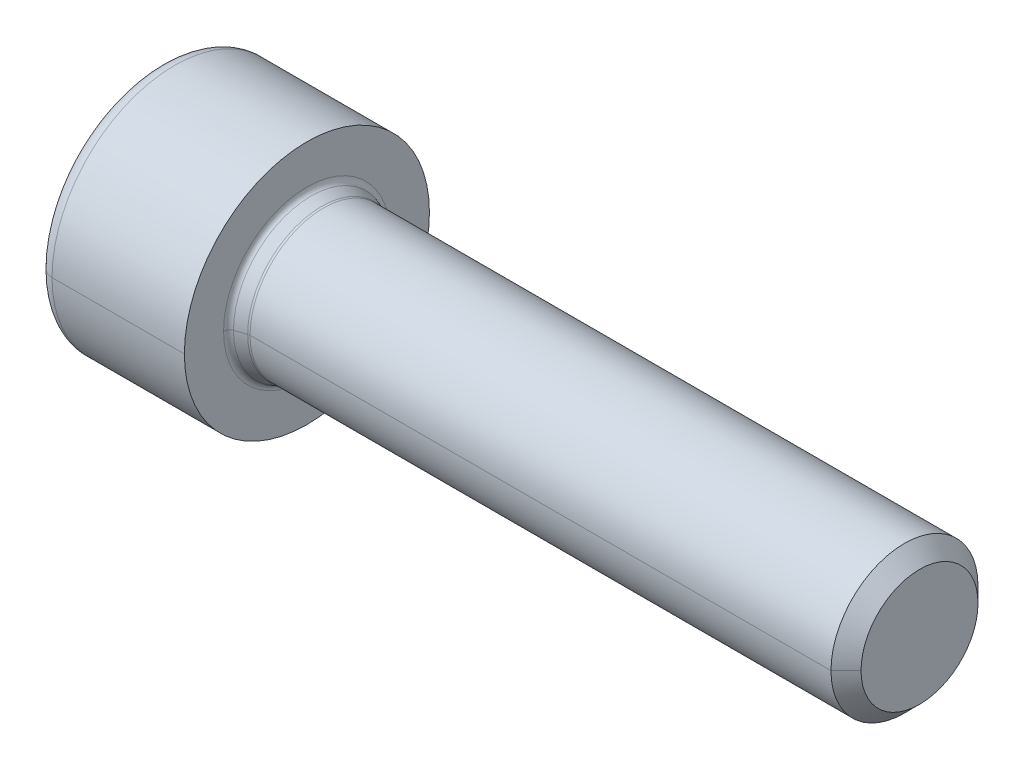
ISO-10303-21;
HEADER;
FILE_DESCRIPTION(('STEP AP214'),'2;1');
FILE_NAME('part.step','',(''),(''),'','','');
FILE_SCHEMA(('AUTOMOTIVE_DESIGN { 1 0 10303 214 1 1 1 1 }'));
ENDSEC;
DATA;
#1=APPLICATION_CONTEXT('core data for automotive mechanical design processes');
#2=APPLICATION_PROTOCOL_DEFINITION('international standard','automotive_design',2000,#1);
#3=PRODUCT_CONTEXT('',#1,'mechanical');
#4=PRODUCT('Part','Part','',(#3));
#5=PRODUCT_RELATED_PRODUCT_CATEGORY('part','',(#4));
#6=PRODUCT_DEFINITION_FORMATION('','',#4);
#7=PRODUCT_DEFINITION_CONTEXT('part definition',#1,'design');
#8=PRODUCT_DEFINITION('design','',#6,#7);
#9=PRODUCT_DEFINITION_SHAPE('','',#8);
#10=(LENGTH_UNIT() NAMED_UNIT(*) SI_UNIT(.MILLI.,.METRE.));
#11=(NAMED_UNIT(*) PLANE_ANGLE_UNIT() SI_UNIT($,.RADIAN.));
#12=(NAMED_UNIT(*) SI_UNIT($,.STERADIAN.) SOLID_ANGLE_UNIT());
#13=UNCERTAINTY_MEASURE_WITH_UNIT(LENGTH_MEASURE(1.E-05),#10,'distance_accuracy_value','');
#14=(GEOMETRIC_REPRESENTATION_CONTEXT(3) GLOBAL_UNCERTAINTY_ASSIGNED_CONTEXT((#13)) GLOBAL_UNIT_ASSIGNED_CONTEXT((#10,
#11,#12)) REPRESENTATION_CONTEXT('',''));
#15=CARTESIAN_POINT('',(0.,0.,0.));
#16=DIRECTION('',(0.,0.,1.));
#17=DIRECTION('',(1.,0.,0.));
#18=AXIS2_PLACEMENT_3D('',#15,#16,#17);
#19=CARTESIAN_POINT('',(-5.819999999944,0.,0.));
#20=DIRECTION('',(-1.,0.,0.));
#21=DIRECTION('',(0.,0.,1.));
#22=AXIS2_PLACEMENT_3D('',#19,#20,#21);
#23=CONICAL_SURFACE('',#22,2.680000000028,0.785398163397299);
#24=CARTESIAN_POINT('',(-5.63999999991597,0.,2.50000000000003));
#25=CARTESIAN_POINT('',(-5.63999755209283,-0.0278620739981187,2.49999893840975));
#26=CARTESIAN_POINT('',(-5.64048147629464,-0.0557238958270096,2.50001574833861));
#27=CARTESIAN_POINT('',(-5.64241318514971,-0.111436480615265,2.50008549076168));
#28=CARTESIAN_POINT('',(-5.64386174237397,-0.139287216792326,2.50013845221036));
#29=CARTESIAN_POINT('',(-5.6477221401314,-0.195042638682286,2.50028118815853));
#30=CARTESIAN_POINT('',(-5.65013812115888,-0.222947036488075,2.50037112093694));
#31=CARTESIAN_POINT('',(-5.65592925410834,-0.278874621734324,2.50058162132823));
#32=CARTESIAN_POINT('',(-5.65931170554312,-0.306897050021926,2.50070242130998));
#33=CARTESIAN_POINT('',(-5.66703289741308,-0.363124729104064,2.50096377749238));
#34=CARTESIAN_POINT('',(-5.67138178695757,-0.391328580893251,2.50110453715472));
#35=CARTESIAN_POINT('',(-5.68103305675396,-0.447982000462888,2.50138986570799));
#36=CARTESIAN_POINT('',(-5.68634803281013,-0.476429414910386,2.50153446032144));
#37=CARTESIAN_POINT('',(-5.69792921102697,-0.533631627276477,2.50180673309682));
#38=CARTESIAN_POINT('',(-5.70421000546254,-0.562383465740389,2.50193408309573));
#39=CARTESIAN_POINT('',(-5.71772088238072,-0.620253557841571,2.50214657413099));
#40=CARTESIAN_POINT('',(-5.72496708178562,-0.649368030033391,2.50223084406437));
#41=CARTESIAN_POINT('',(-5.74839478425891,-0.738364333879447,2.50237698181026));
#42=CARTESIAN_POINT('',(-5.76585707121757,-0.797911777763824,2.50231889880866));
#43=CARTESIAN_POINT('',(-5.80449733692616,-0.919145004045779,2.50163694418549));
#44=CARTESIAN_POINT('',(-5.82581990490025,-0.980783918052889,2.50098422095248));
#45=CARTESIAN_POINT('',(-5.87217205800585,-1.10659561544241,2.49876522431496));
#46=CARTESIAN_POINT('',(-5.89734294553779,-1.17071505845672,2.49714946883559));
#47=CARTESIAN_POINT('',(-5.95142674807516,-1.30182065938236,2.49261729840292));
#48=CARTESIAN_POINT('',(-5.98047335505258,-1.36874940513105,2.48962898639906));
#49=CARTESIAN_POINT('',(-6.01041759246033,-1.43520868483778,2.48585461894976));
#50=B_SPLINE_CURVE_WITH_KNOTS('',3,(#24,#25,#26,#27,#28,#29,#30,#31,#32,#33,#34,#35,#36,#37,#38,
#39,#40,#41,#42,#43,#44,#45,#46,#47,#48,#49),.UNSPECIFIED.,.F.,.F.,(4,2,2,2,2,2,2,2,2,2,2,2,4),
(0.,0.0835815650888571,0.167230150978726,0.251240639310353,0.335903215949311,0.421500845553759,
0.508307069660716,0.596584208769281,0.686582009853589,0.872655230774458,1.06826719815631,
1.27491962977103,1.49391040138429),.UNSPECIFIED.);
#51=CARTESIAN_POINT('',(-5.639999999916,0.,2.5));
#52=VERTEX_POINT('',#51);
#53=CARTESIAN_POINT('',(-6.00966493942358,-1.43845944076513,2.49148506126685));
#54=VERTEX_POINT('',#53);
#55=EDGE_CURVE('E665',#52,#54,#50,.T.);
#56=ORIENTED_EDGE('',*,*,#55,.T.);
#57=CARTESIAN_POINT('',(-6.,0.,2.860000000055));
#58=CARTESIAN_POINT('',(-6.,-0.763915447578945,2.860000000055));
#59=CARTESIAN_POINT('',(-6.,-1.43571045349,2.486723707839));
#60=B_SPLINE_CURVE_WITH_KNOTS('',2,(#57,#58,#59),.UNSPECIFIED.,.F.,.F.,(3,3),(0.,1.),.UNSPECIFIED.);
#61=CARTESIAN_POINT('',(-5.999999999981,0.,2.860000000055));
#62=VERTEX_POINT('',#61);
#63=EDGE_CURVE('E426',#62,#54,#60,.T.);
#64=ORIENTED_EDGE('',*,*,#63,.F.);
#65=DIRECTION('',(0.707106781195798,0.,-0.707106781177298));
#66=VECTOR('',#65,1.);
#67=CARTESIAN_POINT('',(-5.999999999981,0.,2.860000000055));
#68=LINE('',#67,#66);
#69=EDGE_CURVE('E11',#62,#52,#68,.T.);
#70=ORIENTED_EDGE('',*,*,#69,.T.);
#71=EDGE_LOOP('',(#56,#64,#70));
#72=FACE_BOUND('',#71,.T.);
#73=ADVANCED_FACE('F16',(#72),#23,.F.);
#74=CARTESIAN_POINT('',(-5.819999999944,0.,0.));
#75=DIRECTION('',(-1.,0.,0.));
#76=DIRECTION('',(0.,0.,1.));
#77=AXIS2_PLACEMENT_3D('',#74,#75,#76);
#78=CONICAL_SURFACE('',#77,2.680000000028,0.785398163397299);
#79=ORIENTED_EDGE('',*,*,#69,.F.);
#80=CARTESIAN_POINT('',(-6.,1.43755373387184,2.48991654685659));
#81=CARTESIAN_POINT('',(-6.,0.760071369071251,2.860000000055));
#82=CARTESIAN_POINT('',(-6.,0.,2.860000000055));
#83=B_SPLINE_CURVE_WITH_KNOTS('',2,(#80,#81,#82),.UNSPECIFIED.,.F.,.F.,(3,3),(0.,1.),.UNSPECIFIED.);
#84=CARTESIAN_POINT('',(-6.01203462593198,1.43929166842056,2.49292669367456));
#85=VERTEX_POINT('',#84);
#86=EDGE_CURVE('E542',#85,#62,#83,.T.);
#87=ORIENTED_EDGE('',*,*,#86,.F.);
#88=CARTESIAN_POINT('',(-6.01506480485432,1.43753221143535,2.48987926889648));
#89=CARTESIAN_POINT('',(-5.98470006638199,1.37213189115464,2.49255725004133));
#90=CARTESIAN_POINT('',(-5.95529097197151,1.30623933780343,2.49463522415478));
#91=CARTESIAN_POINT('',(-5.90052867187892,1.17690079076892,2.49773772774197));
#92=CARTESIAN_POINT('',(-5.8750427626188,1.11351195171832,2.49881256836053));
#93=CARTESIAN_POINT('',(-5.82810733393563,0.988843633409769,2.50025407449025));
#94=CARTESIAN_POINT('',(-5.80651978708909,0.927616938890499,2.50065343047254));
#95=CARTESIAN_POINT('',(-5.7673932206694,0.806883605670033,2.5010492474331));
#96=CARTESIAN_POINT('',(-5.74971645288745,0.747422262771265,2.50106290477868));
#97=CARTESIAN_POINT('',(-5.72602309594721,0.658418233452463,2.50095720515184));
#98=CARTESIAN_POINT('',(-5.71868687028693,0.62922387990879,2.50090267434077));
#99=CARTESIAN_POINT('',(-5.70500637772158,0.571110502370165,2.50077482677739));
#100=CARTESIAN_POINT('',(-5.69864774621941,0.542194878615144,2.50070183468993));
#101=CARTESIAN_POINT('',(-5.68692113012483,0.484580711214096,2.50055456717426));
#102=CARTESIAN_POINT('',(-5.68154062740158,0.455884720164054,2.50048032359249));
#103=CARTESIAN_POINT('',(-5.67176818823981,0.398648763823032,2.50034310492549));
#104=CARTESIAN_POINT('',(-5.6673660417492,0.370110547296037,2.50028001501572));
#105=CARTESIAN_POINT('',(-5.65954792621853,0.313127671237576,2.50017258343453));
#106=CARTESIAN_POINT('',(-5.6561244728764,0.284684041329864,2.50012809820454));
#107=CARTESIAN_POINT('',(-5.65026066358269,0.227826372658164,2.50005996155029));
#108=CARTESIAN_POINT('',(-5.6478158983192,0.19941278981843,2.50003621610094));
#109=CARTESIAN_POINT('',(-5.64390706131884,0.142550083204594,2.50000662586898));
#110=CARTESIAN_POINT('',(-5.64244189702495,0.114101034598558,2.50000076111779));
#111=CARTESIAN_POINT('',(-5.64048596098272,0.0571013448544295,2.49999693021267));
#112=CARTESIAN_POINT('',(-5.63999752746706,0.0285506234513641,2.4999989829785));
#113=CARTESIAN_POINT('',(-5.63999999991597,0.,2.50000000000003));
#114=B_SPLINE_CURVE_WITH_KNOTS('',3,(#88,#89,#90,#91,#92,#93,#94,#95,#96,#97,#98,#99,#100,#101,
#102,#103,#104,#105,#106,#107,#108,#109,#110,#111,#112,#113),.UNSPECIFIED.,.F.,.F.,(4,2,2,2,2,2,
2,2,2,2,2,2,4),(0.,0.216488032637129,0.421420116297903,0.616116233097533,0.802117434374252,
0.892412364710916,0.981218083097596,1.06879194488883,1.1554038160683,1.24133445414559,
1.32687346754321,1.41231691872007,1.49796467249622),.UNSPECIFIED.);
#115=EDGE_CURVE('E29',#85,#52,#114,.T.);
#116=ORIENTED_EDGE('',*,*,#115,.T.);
#117=EDGE_LOOP('',(#79,#87,#116));
#118=FACE_BOUND('',#117,.T.);
#119=ADVANCED_FACE('F360',(#118),#78,.F.);
#120=CARTESIAN_POINT('',(-2.3,1.443375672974,2.5));
#121=DIRECTION('',(0.,0.,1.));
#122=DIRECTION('',(1.,0.,0.));
#123=AXIS2_PLACEMENT_3D('',#120,#121,#122);
#124=PLANE('',#123);
#125=CARTESIAN_POINT('',(-6.01502175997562,1.43755373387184,2.5));
#126=DIRECTION('',(0.999998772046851,0.00156713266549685,0.));
#127=VECTOR('',#126,1.);
#128=LINE('',#125,#127);
#129=CARTESIAN_POINT('',(-2.3,1.443375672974,2.5));
#130=VERTEX_POINT('',#129);
#131=EDGE_CURVE('E221',#85,#130,#128,.T.);
#132=ORIENTED_EDGE('',*,*,#131,.T.);
#133=DIRECTION('',(0.,-1.,0.));
#134=VECTOR('',#133,1.);
#135=CARTESIAN_POINT('',(-2.3,1.443375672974,2.5));
#136=LINE('',#135,#134);
#137=CARTESIAN_POINT('',(-2.3,-1.443375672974,2.5));
#138=VERTEX_POINT('',#137);
#139=EDGE_CURVE('E342',#130,#138,#136,.T.);
#140=ORIENTED_EDGE('',*,*,#139,.T.);
#141=CARTESIAN_POINT('',(-6.009414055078,-1.44720817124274,2.49336191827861));
#142=DIRECTION('',(0.999997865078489,0.00103317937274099,0.00178951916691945));
#143=VECTOR('',#142,1.);
#144=LINE('',#141,#143);
#145=EDGE_CURVE('E666',#54,#138,#144,.T.);
#146=ORIENTED_EDGE('',*,*,#145,.F.);
#147=ORIENTED_EDGE('',*,*,#55,.F.);
#148=ORIENTED_EDGE('',*,*,#115,.F.);
#149=EDGE_LOOP('',(#132,#140,#146,#147,#148));
#150=FACE_BOUND('',#149,.T.);
#151=ADVANCED_FACE('F351',(#150),#124,.F.);
#152=CARTESIAN_POINT('',(-2.3,-1.443375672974,2.5));
#153=DIRECTION('',(0.,-0.866025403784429,0.500000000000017));
#154=DIRECTION('',(-1.,0.,0.));
#155=AXIS2_PLACEMENT_3D('',#152,#153,#154);
#156=PLANE('',#155);
#157=ORIENTED_EDGE('',*,*,#145,.T.);
#158=DIRECTION('',(0.,0.500000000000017,0.866025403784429));
#159=VECTOR('',#158,1.);
#160=CARTESIAN_POINT('',(-2.3,-2.886751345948,0.));
#161=LINE('',#160,#159);
#162=CARTESIAN_POINT('',(-2.3,-2.886751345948,0.));
#163=VERTEX_POINT('',#162);
#164=EDGE_CURVE('E388',#163,#138,#161,.T.);
#165=ORIENTED_EDGE('',*,*,#164,.F.);
#166=CARTESIAN_POINT('',(-6.00615900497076,-2.88311653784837,-0.00629567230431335));
#167=DIRECTION('',(0.9999980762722,-0.000980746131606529,0.00169870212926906));
#168=VECTOR('',#167,1.);
#169=LINE('',#166,#168);
#170=CARTESIAN_POINT('',(-6.00666325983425,-2.87352338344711,0.00105056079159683));
#171=VERTEX_POINT('',#170);
#172=EDGE_CURVE('E440',#171,#163,#169,.T.);
#173=ORIENTED_EDGE('',*,*,#172,.F.);
#174=CARTESIAN_POINT('',(-6.01041759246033,-1.43520868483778,2.48585461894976));
#175=CARTESIAN_POINT('',(-5.98048306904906,-1.47165075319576,2.43023017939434));
#176=CARTESIAN_POINT('',(-5.95144790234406,-1.50765321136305,2.37380931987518));
#177=CARTESIAN_POINT('',(-5.897382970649,-1.57705120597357,2.26262090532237));
#178=CARTESIAN_POINT('',(-5.87221983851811,-1.61047959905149,2.20793844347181));
#179=CARTESIAN_POINT('',(-5.82587926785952,-1.67526214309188,2.10015973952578));
#180=CARTESIAN_POINT('',(-5.80456097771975,-1.70663199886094,2.04713397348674));
#181=CARTESIAN_POINT('',(-5.76592514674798,-1.7678218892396,1.94253040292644));
#182=CARTESIAN_POINT('',(-5.74846363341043,-1.79764323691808,1.89100725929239));
#183=CARTESIAN_POINT('',(-5.72503526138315,-1.84201486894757,1.81388301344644));
#184=CARTESIAN_POINT('',(-5.71778797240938,-1.85650115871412,1.78863107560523));
#185=CARTESIAN_POINT('',(-5.70427391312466,-1.88525807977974,1.73841280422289));
#186=CARTESIAN_POINT('',(-5.69799113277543,-1.89952758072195,1.71345015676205));
#187=CARTESIAN_POINT('',(-5.68640497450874,-1.92790208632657,1.66377384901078));
#188=CARTESIAN_POINT('',(-5.68108711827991,-1.94200590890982,1.63906289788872));
#189=CARTESIAN_POINT('',(-5.67142907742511,-1.97009727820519,1.58984858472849));
#190=CARTESIAN_POINT('',(-5.66707641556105,-1.9840837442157,1.5653470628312));
#191=CARTESIAN_POINT('',(-5.65934664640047,-2.01198486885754,1.5165065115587));
#192=CARTESIAN_POINT('',(-5.65595951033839,-2.0258986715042,1.49216858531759));
#193=CARTESIAN_POINT('',(-5.65015804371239,-2.05369493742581,1.44360621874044));
#194=CARTESIAN_POINT('',(-5.64773653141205,-2.06757683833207,1.41938231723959));
#195=CARTESIAN_POINT('',(-5.64386385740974,-2.0953462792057,1.37099571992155));
#196=CARTESIAN_POINT('',(-5.64240866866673,-2.10923355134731,1.34683319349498));
#197=CARTESIAN_POINT('',(-5.64046342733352,-2.13704430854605,1.29851244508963));
#198=CARTESIAN_POINT('',(-5.63997270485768,-2.15096776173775,1.27435423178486));
#199=CARTESIAN_POINT('',(-5.6399603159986,-2.17875944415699,1.22620421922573));
#200=CARTESIAN_POINT('',(-5.64043268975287,-2.19262748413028,1.20221231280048));
#201=CARTESIAN_POINT('',(-5.64234225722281,-2.2204069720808,1.15424351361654));
#202=CARTESIAN_POINT('',(-5.64378091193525,-2.23431845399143,1.13026669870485));
#203=CARTESIAN_POINT('',(-5.64761766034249,-2.26221343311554,1.08226955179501));
#204=CARTESIAN_POINT('',(-5.65002055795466,-2.27619693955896,1.05824961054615));
#205=CARTESIAN_POINT('',(-5.65578299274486,-2.30426197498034,1.01010662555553));
#206=CARTESIAN_POINT('',(-5.65915046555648,-2.31834333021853,0.985984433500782));
#207=CARTESIAN_POINT('',(-5.66683886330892,-2.34662473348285,0.937575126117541));
#208=CARTESIAN_POINT('',(-5.67117052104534,-2.360824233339,0.913289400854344));
#209=CARTESIAN_POINT('',(-5.68078464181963,-2.38935790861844,0.864489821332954));
#210=CARTESIAN_POINT('',(-5.68608022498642,-2.40369096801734,0.839977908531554));
#211=CARTESIAN_POINT('',(-5.69761996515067,-2.43250292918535,0.79066137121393));
#212=CARTESIAN_POINT('',(-5.70387917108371,-2.44697996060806,0.765859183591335));
#213=CARTESIAN_POINT('',(-5.71734432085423,-2.47608579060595,0.715897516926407));
#214=CARTESIAN_POINT('',(-5.72456676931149,-2.49071178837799,0.690740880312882));
#215=CARTESIAN_POINT('',(-5.74792493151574,-2.53534102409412,0.613735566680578));
#216=CARTESIAN_POINT('',(-5.76533373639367,-2.56506447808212,0.562107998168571));
#217=CARTESIAN_POINT('',(-5.80385645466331,-2.62509055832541,0.456632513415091));
#218=CARTESIAN_POINT('',(-5.82511651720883,-2.65534218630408,0.40280967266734));
#219=CARTESIAN_POINT('',(-5.87133393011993,-2.71630580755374,0.292420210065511));
#220=CARTESIAN_POINT('',(-5.89643337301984,-2.74694475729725,0.235873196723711));
#221=CARTESIAN_POINT('',(-5.95036564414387,-2.80849739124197,0.119547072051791));
#222=CARTESIAN_POINT('',(-5.97933245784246,-2.83931562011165,0.0597793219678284));
#223=CARTESIAN_POINT('',(-6.0091845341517,-2.8691845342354,1.18239809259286E-06));
#224=B_SPLINE_CURVE_WITH_KNOTS('',3,(#174,#175,#176,#177,#178,#179,#180,#181,#182,#183,#184,
#185,#186,#187,#188,#189,#190,#191,#192,#193,#194,#195,#196,#197,#198,#199,#200,#201,#202,#203,
#204,#205,#206,#207,#208,#209,#210,#211,#212,#213,#214,#215,#216,#217,#218,#219,#220,#221,#222,
#223),.UNSPECIFIED.,.F.,.F.,(4,2,2,2,2,2,2,2,2,2,2,2,2,2,2,2,2,2,2,2,2,2,2,2,4),(0.,
0.218794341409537,0.425301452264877,0.620817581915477,0.806842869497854,0.896834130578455,
0.985116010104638,1.07193796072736,1.15756196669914,1.24226118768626,1.32631816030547,
1.41002259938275,1.49366887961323,1.57679910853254,1.66005531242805,1.74373155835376,
1.82811702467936,1.91349350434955,2.00013324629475,2.08829721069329,2.17823377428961,
2.36433534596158,2.5601690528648,2.76723038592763,2.98681473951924),.UNSPECIFIED.);
#225=EDGE_CURVE('E401',#54,#171,#224,.T.);
#226=ORIENTED_EDGE('',*,*,#225,.F.);
#227=EDGE_LOOP('',(#157,#165,#173,#226));
#228=FACE_BOUND('',#227,.T.);
#229=ADVANCED_FACE('F359',(#228),#156,.F.);
#230=CARTESIAN_POINT('',(-5.818979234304,0.,0.));
#231=DIRECTION('',(-1.,0.,0.));
#232=DIRECTION('',(0.,0.,1.));
#233=AXIS2_PLACEMENT_3D('',#230,#231,#232);
#234=CONICAL_SURFACE('',#233,2.678979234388,0.785398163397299);
#235=CARTESIAN_POINT('',(-6.,-1.43571045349,2.486723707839));
#236=CARTESIAN_POINT('',(-6.,-2.10529396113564,2.07290729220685));
#237=CARTESIAN_POINT('',(-6.,-2.476830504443,1.42999875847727));
#238=CARTESIAN_POINT('',(-6.,-2.84737991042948,0.788798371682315));
#239=CARTESIAN_POINT('',(-6.,-2.87221006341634,1.1836449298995E-06));
#240=B_SPLINE_CURVE_WITH_KNOTS('',2,(#235,#236,#237,#238,#239),.UNSPECIFIED.,.F.,.F.,(3,2,3),
(0.,0.5,1.),.UNSPECIFIED.);
#241=EDGE_CURVE('E422',#54,#171,#240,.T.);
#242=ORIENTED_EDGE('',*,*,#241,.F.);
#243=ORIENTED_EDGE('',*,*,#225,.T.);
#244=EDGE_LOOP('',(#242,#243));
#245=FACE_BOUND('',#244,.T.);
#246=ADVANCED_FACE('F252',(#245),#234,.F.);
#247=CARTESIAN_POINT('',(-6.,0.,-3.63));
#248=DIRECTION('',(-1.,0.,0.));
#249=DIRECTION('',(0.,0.,1.));
#250=AXIS2_PLACEMENT_3D('',#247,#248,#249);
#251=PLANE('',#250);
#252=CARTESIAN_POINT('',(-6.,-2.87221006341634,1.1836449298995E-06));
#253=CARTESIAN_POINT('',(-6.,-2.82089265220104,-1.62959848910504));
#254=CARTESIAN_POINT('',(-6.,-1.43369090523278,-2.48848016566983));
#255=B_SPLINE_CURVE_WITH_KNOTS('',2,(#252,#253,#254),.UNSPECIFIED.,.F.,.F.,(3,3),(0.,1.),.UNSPECIFIED.);
#256=CARTESIAN_POINT('',(-6.00756816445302,-1.43369090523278,-2.48848016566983));
#257=VERTEX_POINT('',#256);
#258=EDGE_CURVE('E424',#171,#257,#255,.T.);
#259=ORIENTED_EDGE('',*,*,#258,.T.);
#260=DIRECTION('',(0.,-1.,0.));
#261=VECTOR('',#260,1.);
#262=CARTESIAN_POINT('',(-6.,0.,-2.5));
#263=LINE('',#262,#261);
#264=CARTESIAN_POINT('',(-6.01070168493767,1.43823503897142,-2.4877194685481));
#265=VERTEX_POINT('',#264);
#266=EDGE_CURVE('E204',#265,#257,#263,.T.);
#267=ORIENTED_EDGE('',*,*,#266,.F.);
#268=CARTESIAN_POINT('',(-6.,1.43823503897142,-2.4877194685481));
#269=CARTESIAN_POINT('',(-6.,2.10648292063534,-2.07084993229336));
#270=CARTESIAN_POINT('',(-6.,2.47683050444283,-1.42999875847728));
#271=CARTESIAN_POINT('',(-6.,2.84757469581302,-0.788461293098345));
#272=CARTESIAN_POINT('',(-6.,2.87193249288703,0.00262733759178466));
#273=B_SPLINE_CURVE_WITH_KNOTS('',2,(#268,#269,#270,#271,#272),.UNSPECIFIED.,.F.,.F.,(3,2,3),
(0.,0.5,1.),.UNSPECIFIED.);
#274=CARTESIAN_POINT('',(-6.00692763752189,2.87550504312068,0.00236380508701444));
#275=VERTEX_POINT('',#274);
#276=EDGE_CURVE('E185',#265,#275,#273,.T.);
#277=ORIENTED_EDGE('',*,*,#276,.T.);
#278=CARTESIAN_POINT('',(-6.,2.87193249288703,0.00262733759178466));
#279=CARTESIAN_POINT('',(-6.,2.82157741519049,1.62100094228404));
#280=CARTESIAN_POINT('',(-6.,1.43755373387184,2.48991654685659));
#281=B_SPLINE_CURVE_WITH_KNOTS('',2,(#278,#279,#280),.UNSPECIFIED.,.F.,.F.,(3,3),(0.,1.),.UNSPECIFIED.);
#282=EDGE_CURVE('E201',#275,#85,#281,.T.);
#283=ORIENTED_EDGE('',*,*,#282,.T.);
#284=ORIENTED_EDGE('',*,*,#86,.T.);
#285=ORIENTED_EDGE('',*,*,#63,.T.);
#286=ORIENTED_EDGE('',*,*,#241,.T.);
#287=EDGE_LOOP('',(#259,#267,#277,#283,#284,#285,#286));
#288=FACE_BOUND('',#287,.T.);
#289=CARTESIAN_POINT('',(-6.,0.,0.));
#290=DIRECTION('',(-1.,0.,0.));
#291=DIRECTION('',(0.,0.,1.));
#292=AXIS2_PLACEMENT_3D('',#289,#290,#291);
#293=CIRCLE('',#292,4.4);
#294=CARTESIAN_POINT('',(-6.,0.,4.4));
#295=VERTEX_POINT('',#294);
#296=CARTESIAN_POINT('',(-6.,0.,-4.4));
#297=VERTEX_POINT('',#296);
#298=EDGE_CURVE('E644',#295,#297,#293,.T.);
#299=ORIENTED_EDGE('',*,*,#298,.T.);
#300=CARTESIAN_POINT('',(-6.,0.,0.));
#301=DIRECTION('',(-1.,0.,0.));
#302=DIRECTION('',(0.,0.,-1.));
#303=AXIS2_PLACEMENT_3D('',#300,#301,#302);
#304=CIRCLE('',#303,4.4);
#305=EDGE_CURVE('E539',#297,#295,#304,.T.);
#306=ORIENTED_EDGE('',*,*,#305,.T.);
#307=EDGE_LOOP('',(#299,#306));
#308=FACE_BOUND('',#307,.T.);
#309=ADVANCED_FACE('F197',(#288,#308),#251,.T.);
#310=CARTESIAN_POINT('',(-5.4,0.,0.));
#311=DIRECTION('',(1.,0.,0.));
#312=DIRECTION('',(0.,0.,-1.));
#313=AXIS2_PLACEMENT_3D('',#310,#311,#312);
#314=TOROIDAL_SURFACE('',#313,4.4,0.6);
#315=CARTESIAN_POINT('',(-5.4,0.,-4.4));
#316=DIRECTION('',(0.,1.,0.));
#317=DIRECTION('',(0.,0.,-1.));
#318=AXIS2_PLACEMENT_3D('',#315,#316,#317);
#319=CIRCLE('',#318,0.6);
#320=CARTESIAN_POINT('',(-5.4,0.,-5.));
#321=VERTEX_POINT('',#320);
#322=EDGE_CURVE('E543',#321,#297,#319,.T.);
#323=ORIENTED_EDGE('',*,*,#322,.F.);
#324=CARTESIAN_POINT('',(-5.4,0.,0.));
#325=DIRECTION('',(-1.,0.,0.));
#326=DIRECTION('',(0.,0.,-1.));
#327=AXIS2_PLACEMENT_3D('',#324,#325,#326);
#328=CIRCLE('',#327,5.);
#329=CARTESIAN_POINT('',(-5.4,0.,5.));
#330=VERTEX_POINT('',#329);
#331=EDGE_CURVE('E634',#321,#330,#328,.T.);
#332=ORIENTED_EDGE('',*,*,#331,.T.);
#333=CARTESIAN_POINT('',(-5.4,0.,4.4));
#334=DIRECTION('',(0.,-1.,0.));
#335=DIRECTION('',(0.,0.,1.));
#336=AXIS2_PLACEMENT_3D('',#333,#334,#335);
#337=CIRCLE('',#336,0.6);
#338=EDGE_CURVE('E648',#330,#295,#337,.T.);
#339=ORIENTED_EDGE('',*,*,#338,.T.);
#340=ORIENTED_EDGE('',*,*,#305,.F.);
#341=EDGE_LOOP('',(#323,#332,#339,#340));
#342=FACE_BOUND('',#341,.T.);
#343=ADVANCED_FACE('F251',(#342),#314,.T.);
#344=CARTESIAN_POINT('',(-5.4,0.,0.));
#345=DIRECTION('',(1.,0.,0.));
#346=DIRECTION('',(0.,0.,1.));
#347=AXIS2_PLACEMENT_3D('',#344,#345,#346);
#348=TOROIDAL_SURFACE('',#347,4.4,0.6);
#349=ORIENTED_EDGE('',*,*,#298,.F.);
#350=ORIENTED_EDGE('',*,*,#338,.F.);
#351=CARTESIAN_POINT('',(-5.4,0.,0.));
#352=DIRECTION('',(-1.,0.,0.));
#353=DIRECTION('',(0.,0.,1.));
#354=AXIS2_PLACEMENT_3D('',#351,#352,#353);
#355=CIRCLE('',#354,5.);
#356=EDGE_CURVE('E580',#330,#321,#355,.T.);
#357=ORIENTED_EDGE('',*,*,#356,.T.);
#358=ORIENTED_EDGE('',*,*,#322,.T.);
#359=EDGE_LOOP('',(#349,#350,#357,#358));
#360=FACE_BOUND('',#359,.T.);
#361=ADVANCED_FACE('F874',(#360),#348,.T.);
#362=CARTESIAN_POINT('',(-2.7,0.,0.));
#363=DIRECTION('',(1.,0.,0.));
#364=DIRECTION('',(0.,0.,1.));
#365=AXIS2_PLACEMENT_3D('',#362,#363,#364);
#366=CYLINDRICAL_SURFACE('',#365,5.);
#367=DIRECTION('',(1.,0.,0.));
#368=VECTOR('',#367,1.);
#369=CARTESIAN_POINT('',(-5.4,0.,-5.));
#370=LINE('',#369,#368);
#371=CARTESIAN_POINT('',(0.,0.,-5.));
#372=VERTEX_POINT('',#371);
#373=EDGE_CURVE('E581',#321,#372,#370,.T.);
#374=ORIENTED_EDGE('',*,*,#373,.F.);
#375=ORIENTED_EDGE('',*,*,#356,.F.);
#376=DIRECTION('',(1.,0.,0.));
#377=VECTOR('',#376,1.);
#378=CARTESIAN_POINT('',(-5.4,0.,5.));
#379=LINE('',#378,#377);
#380=CARTESIAN_POINT('',(0.,0.,5.));
#381=VERTEX_POINT('',#380);
#382=EDGE_CURVE('E630',#330,#381,#379,.T.);
#383=ORIENTED_EDGE('',*,*,#382,.T.);
#384=CARTESIAN_POINT('',(0.,0.,0.));
#385=DIRECTION('',(1.,0.,0.));
#386=DIRECTION('',(0.,0.,-1.));
#387=AXIS2_PLACEMENT_3D('',#384,#385,#386);
#388=CIRCLE('',#387,5.);
#389=EDGE_CURVE('E577',#372,#381,#388,.T.);
#390=ORIENTED_EDGE('',*,*,#389,.F.);
#391=EDGE_LOOP('',(#374,#375,#383,#390));
#392=FACE_BOUND('',#391,.T.);
#393=ADVANCED_FACE('F301',(#392),#366,.T.);
#394=CARTESIAN_POINT('',(0.,0.,-4.2));
#395=DIRECTION('',(1.,0.,0.));
#396=DIRECTION('',(0.,1.,0.));
#397=AXIS2_PLACEMENT_3D('',#394,#395,#396);
#398=PLANE('',#397);
#399=CARTESIAN_POINT('',(0.,0.,0.));
#400=DIRECTION('',(-1.,0.,0.));
#401=DIRECTION('',(0.,0.,1.));
#402=AXIS2_PLACEMENT_3D('',#399,#400,#401);
#403=CIRCLE('',#402,3.4);
#404=CARTESIAN_POINT('',(0.,0.,3.4));
#405=VERTEX_POINT('',#404);
#406=CARTESIAN_POINT('',(0.,0.,-3.4));
#407=VERTEX_POINT('',#406);
#408=EDGE_CURVE('E617',#405,#407,#403,.T.);
#409=ORIENTED_EDGE('',*,*,#408,.T.);
#410=CARTESIAN_POINT('',(0.,0.,0.));
#411=DIRECTION('',(-1.,0.,0.));
#412=DIRECTION('',(0.,0.,-1.));
#413=AXIS2_PLACEMENT_3D('',#410,#411,#412);
#414=CIRCLE('',#413,3.4);
#415=EDGE_CURVE('E537',#407,#405,#414,.T.);
#416=ORIENTED_EDGE('',*,*,#415,.T.);
#417=EDGE_LOOP('',(#409,#416));
#418=FACE_BOUND('',#417,.T.);
#419=ORIENTED_EDGE('',*,*,#389,.T.);
#420=CARTESIAN_POINT('',(0.,0.,0.));
#421=DIRECTION('',(1.,0.,0.));
#422=DIRECTION('',(0.,0.,1.));
#423=AXIS2_PLACEMENT_3D('',#420,#421,#422);
#424=CIRCLE('',#423,5.);
#425=EDGE_CURVE('E626',#381,#372,#424,.T.);
#426=ORIENTED_EDGE('',*,*,#425,.T.);
#427=EDGE_LOOP('',(#419,#426));
#428=FACE_BOUND('',#427,.T.);
#429=ADVANCED_FACE('F873',(#418,#428),#398,.T.);
#430=CARTESIAN_POINT('',(-2.7,0.,0.));
#431=DIRECTION('',(1.,0.,0.));
#432=DIRECTION('',(0.,0.,1.));
#433=AXIS2_PLACEMENT_3D('',#430,#431,#432);
#434=CYLINDRICAL_SURFACE('',#433,5.);
#435=ORIENTED_EDGE('',*,*,#425,.F.);
#436=ORIENTED_EDGE('',*,*,#382,.F.);
#437=ORIENTED_EDGE('',*,*,#331,.F.);
#438=ORIENTED_EDGE('',*,*,#373,.T.);
#439=EDGE_LOOP('',(#435,#436,#437,#438));
#440=FACE_BOUND('',#439,.T.);
#441=ADVANCED_FACE('F934',(#440),#434,.T.);
#442=CARTESIAN_POINT('',(0.2499999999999,0.,0.));
#443=DIRECTION('',(1.,0.,0.));
#444=DIRECTION('',(0.,0.,-1.));
#445=AXIS2_PLACEMENT_3D('',#442,#443,#444);
#446=TOROIDAL_SURFACE('',#445,3.4,0.25);
#447=CARTESIAN_POINT('',(0.25,0.,-3.4));
#448=DIRECTION('',(0.,-1.,0.));
#449=DIRECTION('',(-0.329372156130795,0.,0.944200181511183));
#450=AXIS2_PLACEMENT_3D('',#447,#448,#449);
#451=CIRCLE('',#450,0.25);
#452=CARTESIAN_POINT('',(0.1676569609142,0.,-3.163949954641));
#453=VERTEX_POINT('',#452);
#454=EDGE_CURVE('E533',#453,#407,#451,.T.);
#455=ORIENTED_EDGE('',*,*,#454,.F.);
#456=CARTESIAN_POINT('',(0.1676569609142,0.,0.));
#457=DIRECTION('',(-1.,0.,0.));
#458=DIRECTION('',(0.,0.,-1.));
#459=AXIS2_PLACEMENT_3D('',#456,#457,#458);
#460=CIRCLE('',#459,3.163949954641);
#461=CARTESIAN_POINT('',(0.1676569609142,0.,3.163949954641));
#462=VERTEX_POINT('',#461);
#463=EDGE_CURVE('E594',#453,#462,#460,.T.);
#464=ORIENTED_EDGE('',*,*,#463,.T.);
#465=CARTESIAN_POINT('',(0.2499999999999,0.,3.4));
#466=DIRECTION('',(0.,1.,0.));
#467=DIRECTION('',(-0.329372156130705,0.,-0.944200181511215));
#468=AXIS2_PLACEMENT_3D('',#465,#466,#467);
#469=CIRCLE('',#468,0.25);
#470=EDGE_CURVE('E538',#462,#405,#469,.T.);
#471=ORIENTED_EDGE('',*,*,#470,.T.);
#472=ORIENTED_EDGE('',*,*,#415,.F.);
#473=EDGE_LOOP('',(#455,#464,#471,#472));
#474=FACE_BOUND('',#473,.T.);
#475=ADVANCED_FACE('F960',(#474),#446,.F.);
#476=CARTESIAN_POINT('',(0.25,0.,0.));
#477=DIRECTION('',(1.,0.,0.));
#478=DIRECTION('',(0.,0.,1.));
#479=AXIS2_PLACEMENT_3D('',#476,#477,#478);
#480=TOROIDAL_SURFACE('',#479,3.4,0.25);
#481=ORIENTED_EDGE('',*,*,#408,.F.);
#482=ORIENTED_EDGE('',*,*,#470,.F.);
#483=CARTESIAN_POINT('',(0.1676569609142,0.,0.));
#484=DIRECTION('',(-1.,0.,0.));
#485=DIRECTION('',(0.,0.,1.));
#486=AXIS2_PLACEMENT_3D('',#483,#484,#485);
#487=CIRCLE('',#486,3.163949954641);
#488=EDGE_CURVE('E613',#462,#453,#487,.T.);
#489=ORIENTED_EDGE('',*,*,#488,.T.);
#490=ORIENTED_EDGE('',*,*,#454,.T.);
#491=EDGE_LOOP('',(#481,#482,#489,#490));
#492=FACE_BOUND('',#491,.T.);
#493=ADVANCED_FACE('F951',(#492),#480,.F.);
#494=CARTESIAN_POINT('',(0.3826569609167,0.,0.));
#495=DIRECTION('',(-1.,0.,0.));
#496=DIRECTION('',(0.,0.,1.));
#497=AXIS2_PLACEMENT_3D('',#494,#495,#496);
#498=CONICAL_SURFACE('',#497,3.088949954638,0.335638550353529);
#499=DIRECTION('',(0.944200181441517,0.,0.329372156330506));
#500=VECTOR('',#499,1.);
#501=CARTESIAN_POINT('',(0.1676569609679,0.,-3.163949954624));
#502=LINE('',#501,#500);
#503=CARTESIAN_POINT('',(0.5976569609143,0.,-3.013949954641));
#504=VERTEX_POINT('',#503);
#505=EDGE_CURVE('E598',#453,#504,#502,.T.);
#506=ORIENTED_EDGE('',*,*,#505,.F.);
#507=ORIENTED_EDGE('',*,*,#488,.F.);
#508=DIRECTION('',(0.944200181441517,0.,-0.329372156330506));
#509=VECTOR('',#508,1.);
#510=CARTESIAN_POINT('',(0.1676569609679,0.,3.163949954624));
#511=LINE('',#510,#509);
#512=CARTESIAN_POINT('',(0.5976569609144,0.,3.013949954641));
#513=VERTEX_POINT('',#512);
#514=EDGE_CURVE('E562',#462,#513,#511,.T.);
#515=ORIENTED_EDGE('',*,*,#514,.T.);
#516=CARTESIAN_POINT('',(0.5976569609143,0.,0.));
#517=DIRECTION('',(1.,0.,0.));
#518=DIRECTION('',(0.,0.,-1.));
#519=AXIS2_PLACEMENT_3D('',#516,#517,#518);
#520=CIRCLE('',#519,3.013949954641);
#521=EDGE_CURVE('E610',#504,#513,#520,.T.);
#522=ORIENTED_EDGE('',*,*,#521,.F.);
#523=EDGE_LOOP('',(#506,#507,#515,#522));
#524=FACE_BOUND('',#523,.T.);
#525=ADVANCED_FACE('F900',(#524),#498,.T.);
#526=CARTESIAN_POINT('',(0.6800000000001,0.,0.));
#527=DIRECTION('',(1.,0.,0.));
#528=DIRECTION('',(0.,0.,1.));
#529=AXIS2_PLACEMENT_3D('',#526,#527,#528);
#530=TOROIDAL_SURFACE('',#529,3.25,0.25);
#531=ORIENTED_EDGE('',*,*,#521,.T.);
#532=CARTESIAN_POINT('',(0.6800000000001,0.,3.25));
#533=DIRECTION('',(0.,1.,0.));
#534=DIRECTION('',(0.,0.,-1.));
#535=AXIS2_PLACEMENT_3D('',#532,#533,#534);
#536=CIRCLE('',#535,0.25);
#537=CARTESIAN_POINT('',(0.6800000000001,0.,3.));
#538=VERTEX_POINT('',#537);
#539=EDGE_CURVE('E606',#538,#513,#536,.T.);
#540=ORIENTED_EDGE('',*,*,#539,.F.);
#541=CARTESIAN_POINT('',(0.6800000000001,0.,0.));
#542=DIRECTION('',(-1.,0.,0.));
#543=DIRECTION('',(0.,0.,1.));
#544=AXIS2_PLACEMENT_3D('',#541,#542,#543);
#545=CIRCLE('',#544,3.);
#546=CARTESIAN_POINT('',(0.6800000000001,0.,-3.));
#547=VERTEX_POINT('',#546);
#548=EDGE_CURVE('E548',#538,#547,#545,.T.);
#549=ORIENTED_EDGE('',*,*,#548,.T.);
#550=CARTESIAN_POINT('',(0.6800000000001,0.,-3.25));
#551=DIRECTION('',(0.,-1.,0.));
#552=DIRECTION('',(0.,0.,1.));
#553=AXIS2_PLACEMENT_3D('',#550,#551,#552);
#554=CIRCLE('',#553,0.25);
#555=EDGE_CURVE('E602',#547,#504,#554,.T.);
#556=ORIENTED_EDGE('',*,*,#555,.T.);
#557=EDGE_LOOP('',(#531,#540,#549,#556));
#558=FACE_BOUND('',#557,.T.);
#559=ADVANCED_FACE('F895',(#558),#530,.F.);
#560=CARTESIAN_POINT('',(0.6800000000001,0.,0.));
#561=DIRECTION('',(1.,0.,0.));
#562=DIRECTION('',(0.,0.,-1.));
#563=AXIS2_PLACEMENT_3D('',#560,#561,#562);
#564=TOROIDAL_SURFACE('',#563,3.25,0.25);
#565=ORIENTED_EDGE('',*,*,#555,.F.);
#566=CARTESIAN_POINT('',(0.6800000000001,0.,0.));
#567=DIRECTION('',(-1.,0.,0.));
#568=DIRECTION('',(0.,0.,-1.));
#569=AXIS2_PLACEMENT_3D('',#566,#567,#568);
#570=CIRCLE('',#569,3.);
#571=EDGE_CURVE('E547',#547,#538,#570,.T.);
#572=ORIENTED_EDGE('',*,*,#571,.T.);
#573=ORIENTED_EDGE('',*,*,#539,.T.);
#574=CARTESIAN_POINT('',(0.5976569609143,0.,0.));
#575=DIRECTION('',(1.,0.,0.));
#576=DIRECTION('',(0.,0.,1.));
#577=AXIS2_PLACEMENT_3D('',#574,#575,#576);
#578=CIRCLE('',#577,3.013949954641);
#579=EDGE_CURVE('E558',#513,#504,#578,.T.);
#580=ORIENTED_EDGE('',*,*,#579,.T.);
#581=EDGE_LOOP('',(#565,#572,#573,#580));
#582=FACE_BOUND('',#581,.T.);
#583=ADVANCED_FACE('F899',(#582),#564,.F.);
#584=CARTESIAN_POINT('',(0.3826569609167,0.,0.));
#585=DIRECTION('',(-1.,0.,0.));
#586=DIRECTION('',(0.,0.,1.));
#587=AXIS2_PLACEMENT_3D('',#584,#585,#586);
#588=CONICAL_SURFACE('',#587,3.088949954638,0.335638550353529);
#589=ORIENTED_EDGE('',*,*,#579,.F.);
#590=ORIENTED_EDGE('',*,*,#514,.F.);
#591=ORIENTED_EDGE('',*,*,#463,.F.);
#592=ORIENTED_EDGE('',*,*,#505,.T.);
#593=EDGE_LOOP('',(#589,#590,#591,#592));
#594=FACE_BOUND('',#593,.T.);
#595=ADVANCED_FACE('F493',(#594),#588,.T.);
#596=CARTESIAN_POINT('',(12.53325,0.,0.));
#597=DIRECTION('',(1.,0.,0.));
#598=DIRECTION('',(0.,0.,1.));
#599=AXIS2_PLACEMENT_3D('',#596,#597,#598);
#600=CYLINDRICAL_SURFACE('',#599,3.);
#601=CARTESIAN_POINT('',(24.38649999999,0.,0.));
#602=DIRECTION('',(1.,0.,0.));
#603=DIRECTION('',(0.,0.,1.));
#604=AXIS2_PLACEMENT_3D('',#601,#602,#603);
#605=CIRCLE('',#604,2.999999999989);
#606=CARTESIAN_POINT('',(24.38649999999,0.,2.999999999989));
#607=VERTEX_POINT('',#606);
#608=CARTESIAN_POINT('',(24.38649999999,0.,-2.999999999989));
#609=VERTEX_POINT('',#608);
#610=EDGE_CURVE('E563',#607,#609,#605,.T.);
#611=ORIENTED_EDGE('',*,*,#610,.F.);
#612=DIRECTION('',(1.,0.,-2.389369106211E-13));
#613=VECTOR('',#612,1.);
#614=CARTESIAN_POINT('',(0.68,0.,3.));
#615=LINE('',#614,#613);
#616=EDGE_CURVE('E544',#538,#607,#615,.T.);
#617=ORIENTED_EDGE('',*,*,#616,.F.);
#618=ORIENTED_EDGE('',*,*,#571,.F.);
#619=DIRECTION('',(1.,0.,2.389369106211E-13));
#620=VECTOR('',#619,1.);
#621=CARTESIAN_POINT('',(0.68,0.,-3.));
#622=LINE('',#621,#620);
#623=EDGE_CURVE('E555',#547,#609,#622,.T.);
#624=ORIENTED_EDGE('',*,*,#623,.T.);
#625=EDGE_LOOP('',(#611,#617,#618,#624));
#626=FACE_BOUND('',#625,.T.);
#627=ADVANCED_FACE('F834',(#626),#600,.T.);
#628=CARTESIAN_POINT('',(12.53325,0.,0.));
#629=DIRECTION('',(1.,0.,0.));
#630=DIRECTION('',(0.,0.,1.));
#631=AXIS2_PLACEMENT_3D('',#628,#629,#630);
#632=CYLINDRICAL_SURFACE('',#631,3.);
#633=ORIENTED_EDGE('',*,*,#623,.F.);
#634=ORIENTED_EDGE('',*,*,#548,.F.);
#635=ORIENTED_EDGE('',*,*,#616,.T.);
#636=CARTESIAN_POINT('',(24.38649999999,0.,0.));
#637=DIRECTION('',(1.,0.,0.));
#638=DIRECTION('',(0.,0.,-1.));
#639=AXIS2_PLACEMENT_3D('',#636,#637,#638);
#640=CIRCLE('',#639,2.999999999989);
#641=EDGE_CURVE('E553',#609,#607,#640,.T.);
#642=ORIENTED_EDGE('',*,*,#641,.F.);
#643=EDGE_LOOP('',(#633,#634,#635,#642));
#644=FACE_BOUND('',#643,.T.);
#645=ADVANCED_FACE('F830',(#644),#632,.T.);
#646=CARTESIAN_POINT('',(24.69324999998,0.,0.));
#647=DIRECTION('',(-1.,0.,0.));
#648=DIRECTION('',(0.,0.,1.));
#649=AXIS2_PLACEMENT_3D('',#646,#647,#648);
#650=CONICAL_SURFACE('',#649,2.693249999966,0.785398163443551);
#651=DIRECTION('',(0.707106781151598,0.,0.707106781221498));
#652=VECTOR('',#651,1.);
#653=CARTESIAN_POINT('',(24.38649999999,0.,-2.999999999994));
#654=LINE('',#653,#652);
#655=CARTESIAN_POINT('',(24.99999999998,0.,-2.386499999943));
#656=VERTEX_POINT('',#655);
#657=EDGE_CURVE('E554',#609,#656,#654,.T.);
#658=ORIENTED_EDGE('',*,*,#657,.F.);
#659=ORIENTED_EDGE('',*,*,#641,.T.);
#660=DIRECTION('',(0.707106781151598,0.,-0.707106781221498));
#661=VECTOR('',#660,1.);
#662=CARTESIAN_POINT('',(24.38649999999,0.,2.999999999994));
#663=LINE('',#662,#661);
#664=CARTESIAN_POINT('',(24.99999999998,0.,2.386499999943));
#665=VERTEX_POINT('',#664);
#666=EDGE_CURVE('E567',#607,#665,#663,.T.);
#667=ORIENTED_EDGE('',*,*,#666,.T.);
#668=CARTESIAN_POINT('',(24.99999999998,0.,0.));
#669=DIRECTION('',(1.,0.,0.));
#670=DIRECTION('',(0.,0.,-1.));
#671=AXIS2_PLACEMENT_3D('',#668,#669,#670);
#672=CIRCLE('',#671,2.386499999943);
#673=EDGE_CURVE('E549',#656,#665,#672,.T.);
#674=ORIENTED_EDGE('',*,*,#673,.F.);
#675=EDGE_LOOP('',(#658,#659,#667,#674));
#676=FACE_BOUND('',#675,.T.);
#677=ADVANCED_FACE('F494',(#676),#650,.T.);
#678=CARTESIAN_POINT('',(25.,0.,-1.19325));
#679=DIRECTION('',(1.,0.,0.));
#680=DIRECTION('',(0.,1.,0.));
#681=AXIS2_PLACEMENT_3D('',#678,#679,#680);
#682=PLANE('',#681);
#683=CARTESIAN_POINT('',(24.99999999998,0.,0.));
#684=DIRECTION('',(1.,0.,0.));
#685=DIRECTION('',(0.,0.,1.));
#686=AXIS2_PLACEMENT_3D('',#683,#684,#685);
#687=CIRCLE('',#686,2.386499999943);
#688=EDGE_CURVE('E435',#665,#656,#687,.T.);
#689=ORIENTED_EDGE('',*,*,#688,.T.);
#690=ORIENTED_EDGE('',*,*,#673,.T.);
#691=EDGE_LOOP('',(#689,#690));
#692=FACE_BOUND('',#691,.T.);
#693=ADVANCED_FACE('F855',(#692),#682,.T.);
#694=CARTESIAN_POINT('',(24.69324999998,0.,0.));
#695=DIRECTION('',(-1.,0.,0.));
#696=DIRECTION('',(0.,0.,1.));
#697=AXIS2_PLACEMENT_3D('',#694,#695,#696);
#698=CONICAL_SURFACE('',#697,2.693249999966,0.785398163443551);
#699=ORIENTED_EDGE('',*,*,#688,.F.);
#700=ORIENTED_EDGE('',*,*,#666,.F.);
#701=ORIENTED_EDGE('',*,*,#610,.T.);
#702=ORIENTED_EDGE('',*,*,#657,.T.);
#703=EDGE_LOOP('',(#699,#700,#701,#702));
#704=FACE_BOUND('',#703,.T.);
#705=ADVANCED_FACE('F800',(#704),#698,.T.);
#706=CARTESIAN_POINT('',(-5.818979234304,0.,0.));
#707=DIRECTION('',(-1.,0.,0.));
#708=DIRECTION('',(0.,0.,1.));
#709=AXIS2_PLACEMENT_3D('',#706,#707,#708);
#710=CONICAL_SURFACE('',#709,2.678979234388,0.785398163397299);
#711=ORIENTED_EDGE('',*,*,#258,.F.);
#712=CARTESIAN_POINT('',(-6.0091845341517,-2.8691845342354,1.18239809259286E-06));
#713=CARTESIAN_POINT('',(-5.9789448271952,-2.8389265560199,-0.0605518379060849));
#714=CARTESIAN_POINT('',(-5.94955386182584,-2.80763698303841,-0.121033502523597));
#715=CARTESIAN_POINT('',(-5.89483431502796,-2.74512682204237,-0.238467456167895));
#716=CARTESIAN_POINT('',(-5.86936776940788,-2.71401493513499,-0.295413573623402));
#717=CARTESIAN_POINT('',(-5.8224758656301,-2.65214210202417,-0.406315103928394));
#718=CARTESIAN_POINT('',(-5.80090218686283,-2.62146428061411,-0.460253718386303));
#719=CARTESIAN_POINT('',(-5.76181532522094,-2.56066912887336,-0.565713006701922));
#720=CARTESIAN_POINT('',(-5.74414662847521,-2.53060966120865,-0.617208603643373));
#721=CARTESIAN_POINT('',(-5.72041963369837,-2.48551694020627,-0.693936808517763));
#722=CARTESIAN_POINT('',(-5.71309016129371,-2.47077078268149,-0.718947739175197));
#723=CARTESIAN_POINT('',(-5.69942660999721,-2.44146107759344,-0.768569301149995));
#724=CARTESIAN_POINT('',(-5.69307423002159,-2.42690061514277,-0.793176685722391));
#725=CARTESIAN_POINT('',(-5.68136389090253,-2.39796251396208,-0.842059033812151));
#726=CARTESIAN_POINT('',(-5.67598891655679,-2.38358686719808,-0.866331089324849));
#727=CARTESIAN_POINT('',(-5.66623193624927,-2.35501289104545,-0.914610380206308));
#728=CARTESIAN_POINT('',(-5.6618347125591,-2.34081566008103,-0.938615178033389));
#729=CARTESIAN_POINT('',(-5.65403125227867,-2.312587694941,-0.986425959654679));
#730=CARTESIAN_POINT('',(-5.65061210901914,-2.29855738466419,-1.01023007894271));
#731=CARTESIAN_POINT('',(-5.64476231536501,-2.27064709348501,-1.05770394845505));
#732=CARTESIAN_POINT('',(-5.64232154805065,-2.25676709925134,-1.08137243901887));
#733=CARTESIAN_POINT('',(-5.63842554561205,-2.22913603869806,-1.12863764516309));
#734=CARTESIAN_POINT('',(-5.63696338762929,-2.21538476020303,-1.1522336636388));
#735=CARTESIAN_POINT('',(-5.63502126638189,-2.18798460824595,-1.19941448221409));
#736=CARTESIAN_POINT('',(-5.63453786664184,-2.17433554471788,-1.22299902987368));
#737=CARTESIAN_POINT('',(-5.63454967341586,-2.14710833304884,-1.27021521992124));
#738=CARTESIAN_POINT('',(-5.63504508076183,-2.13353020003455,-1.29384687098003));
#739=CARTESIAN_POINT('',(-5.63701081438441,-2.10640858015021,-1.34121313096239));
#740=CARTESIAN_POINT('',(-5.63848497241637,-2.09286544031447,-1.36494777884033));
#741=CARTESIAN_POINT('',(-5.6424045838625,-2.06577297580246,-1.41257322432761));
#742=CARTESIAN_POINT('',(-5.64485733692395,-2.052224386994,-1.43646383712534));
#743=CARTESIAN_POINT('',(-5.65073073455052,-2.02507587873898,-1.48445148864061));
#744=CARTESIAN_POINT('',(-5.65416184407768,-2.01147706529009,-1.50854786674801));
#745=CARTESIAN_POINT('',(-5.66198890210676,-1.98417889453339,-1.5569941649));
#746=CARTESIAN_POINT('',(-5.66639806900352,-1.970480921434,-1.58134272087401));
#747=CARTESIAN_POINT('',(-5.67617864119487,-1.9429314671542,-1.63033700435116));
#748=CARTESIAN_POINT('',(-5.68156553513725,-1.92908149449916,-1.65498047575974));
#749=CARTESIAN_POINT('',(-5.69329945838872,-1.90117140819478,-1.70460466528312));
#750=CARTESIAN_POINT('',(-5.69966373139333,-1.88711272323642,-1.72958209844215));
#751=CARTESIAN_POINT('',(-5.71335086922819,-1.85872588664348,-1.779909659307));
#752=CARTESIAN_POINT('',(-5.72069222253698,-1.84439886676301,-1.80525536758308));
#753=CARTESIAN_POINT('',(-5.74445800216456,-1.80035044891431,-1.88290039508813));
#754=CARTESIAN_POINT('',(-5.76215065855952,-1.7706648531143,-1.93483449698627));
#755=CARTESIAN_POINT('',(-5.80128455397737,-1.70943658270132,-2.04053868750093));
#756=CARTESIAN_POINT('',(-5.82288197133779,-1.67788449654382,-2.09424471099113));
#757=CARTESIAN_POINT('',(-5.86982091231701,-1.6123533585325,-2.2036269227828));
#758=CARTESIAN_POINT('',(-5.89531104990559,-1.57834443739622,-2.25922098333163));
#759=CARTESIAN_POINT('',(-5.95007780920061,-1.50732713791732,-2.37243049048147));
#760=CARTESIAN_POINT('',(-5.97949246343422,-1.47026637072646,-2.42994655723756));
#761=CARTESIAN_POINT('',(-6.00975092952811,-1.43260125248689,-2.48658883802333));
#762=B_SPLINE_CURVE_WITH_KNOTS('',3,(#712,#713,#714,#715,#716,#717,#718,#719,#720,#721,#722,
#723,#724,#725,#726,#727,#728,#729,#730,#731,#732,#733,#734,#735,#736,#737,#738,#739,#740,#741,
#742,#743,#744,#745,#746,#747,#748,#749,#750,#751,#752,#753,#754,#755,#756,#757,#758,#759,#760,
#761),.UNSPECIFIED.,.F.,.F.,(4,2,2,2,2,2,2,2,2,2,2,2,2,2,2,2,2,2,2,2,2,2,2,2,4),(0.,
0.222431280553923,0.431504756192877,0.628528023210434,0.815007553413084,0.904832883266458,
0.992688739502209,1.0788267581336,1.16351204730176,1.24702201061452,1.32964466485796,
1.41167647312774,1.4934197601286,1.57517982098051,1.65726187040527,1.73996799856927,
1.8235942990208,1.9084283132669,1.99474689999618,2.08281459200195,2.17288245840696,
2.35993723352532,2.55765332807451,2.76753592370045,2.99089356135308),.UNSPECIFIED.);
#763=EDGE_CURVE('E431',#171,#257,#762,.T.);
#764=ORIENTED_EDGE('',*,*,#763,.T.);
#765=EDGE_LOOP('',(#711,#764));
#766=FACE_BOUND('',#765,.T.);
#767=ADVANCED_FACE('F430',(#766),#710,.F.);
#768=CARTESIAN_POINT('',(-2.3,-2.886751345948,0.));
#769=DIRECTION('',(0.,-0.866025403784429,-0.500000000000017));
#770=DIRECTION('',(0.,0.500000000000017,-0.866025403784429));
#771=AXIS2_PLACEMENT_3D('',#768,#769,#770);
#772=PLANE('',#771);
#773=ORIENTED_EDGE('',*,*,#172,.T.);
#774=DIRECTION('',(0.,-0.500000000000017,0.866025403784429));
#775=VECTOR('',#774,1.);
#776=CARTESIAN_POINT('',(-2.3,-1.443375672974,-2.5));
#777=LINE('',#776,#775);
#778=CARTESIAN_POINT('',(-2.3,-1.443375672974,-2.5));
#779=VERTEX_POINT('',#778);
#780=EDGE_CURVE('E394',#779,#163,#777,.T.);
#781=ORIENTED_EDGE('',*,*,#780,.F.);
#782=CARTESIAN_POINT('',(-2.3,-1.4433756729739,-2.49999999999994));
#783=DIRECTION('',(-0.999999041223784,-0.000692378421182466,0.00119923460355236));
#784=VECTOR('',#783,1.);
#785=LINE('',#782,#784);
#786=EDGE_CURVE('E443',#779,#257,#785,.T.);
#787=ORIENTED_EDGE('',*,*,#786,.T.);
#788=ORIENTED_EDGE('',*,*,#763,.F.);
#789=EDGE_LOOP('',(#773,#781,#787,#788));
#790=FACE_BOUND('',#789,.T.);
#791=ADVANCED_FACE('F322',(#790),#772,.F.);
#792=CARTESIAN_POINT('',(-2.3,-1.443375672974,-2.5));
#793=DIRECTION('',(0.,0.,-1.));
#794=DIRECTION('',(0.,-1.,0.));
#795=AXIS2_PLACEMENT_3D('',#792,#793,#794);
#796=PLANE('',#795);
#797=DIRECTION('',(0.,1.,0.));
#798=VECTOR('',#797,1.);
#799=CARTESIAN_POINT('',(-2.3,-1.443375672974,-2.5));
#800=LINE('',#799,#798);
#801=CARTESIAN_POINT('',(-2.3,1.443375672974,-2.5));
#802=VERTEX_POINT('',#801);
#803=EDGE_CURVE('E465',#779,#802,#800,.T.);
#804=ORIENTED_EDGE('',*,*,#803,.T.);
#805=CARTESIAN_POINT('',(-6.01070168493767,1.44740814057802,-2.49301556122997));
#806=DIRECTION('',(0.999997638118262,-0.00108671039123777,-0.00188223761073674));
#807=VECTOR('',#806,1.);
#808=LINE('',#805,#807);
#809=EDGE_CURVE('E191',#265,#802,#808,.T.);
#810=ORIENTED_EDGE('',*,*,#809,.F.);
#811=ORIENTED_EDGE('',*,*,#266,.T.);
#812=ORIENTED_EDGE('',*,*,#786,.F.);
#813=EDGE_LOOP('',(#804,#810,#811,#812));
#814=FACE_BOUND('',#813,.T.);
#815=ADVANCED_FACE('F321',(#814),#796,.F.);
#816=CARTESIAN_POINT('',(-2.3,1.443375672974,-2.5));
#817=DIRECTION('',(0.,0.866025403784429,-0.500000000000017));
#818=DIRECTION('',(-1.,0.,0.));
#819=AXIS2_PLACEMENT_3D('',#816,#817,#818);
#820=PLANE('',#819);
#821=DIRECTION('',(0.,-0.500000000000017,-0.866025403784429));
#822=VECTOR('',#821,1.);
#823=CARTESIAN_POINT('',(-2.3,2.886751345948,0.));
#824=LINE('',#823,#822);
#825=CARTESIAN_POINT('',(-2.3,2.886751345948,0.));
#826=VERTEX_POINT('',#825);
#827=EDGE_CURVE('E215',#826,#802,#824,.T.);
#828=ORIENTED_EDGE('',*,*,#827,.F.);
#829=CARTESIAN_POINT('',(-6.00756816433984,2.88190896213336,0.00838725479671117));
#830=DIRECTION('',(0.999996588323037,0.00130607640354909,-0.00226219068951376));
#831=VECTOR('',#830,1.);
#832=LINE('',#829,#831);
#833=EDGE_CURVE('E207',#275,#826,#832,.T.);
#834=ORIENTED_EDGE('',*,*,#833,.F.);
#835=CARTESIAN_POINT('',(-6.01212397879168,1.43752316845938,-2.48648814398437));
#836=CARTESIAN_POINT('',(-5.98202496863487,1.47306803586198,-2.43115253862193));
#837=CARTESIAN_POINT('',(-5.95285720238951,1.50827207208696,-2.37506483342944));
#838=CARTESIAN_POINT('',(-5.89854331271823,1.57635992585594,-2.26449953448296));
#839=CARTESIAN_POINT('',(-5.87326473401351,1.60926578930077,-2.2101003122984));
#840=CARTESIAN_POINT('',(-5.82670977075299,1.67324923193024,-2.10281385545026));
#841=CARTESIAN_POINT('',(-5.80529478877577,1.70433421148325,-2.04999167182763));
#842=CARTESIAN_POINT('',(-5.76648022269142,1.76515927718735,-1.94569413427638));
#843=CARTESIAN_POINT('',(-5.74894097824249,1.79489525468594,-1.89426905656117));
#844=CARTESIAN_POINT('',(-5.72542113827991,1.83923103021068,-1.81725465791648));
#845=CARTESIAN_POINT('',(-5.71814098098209,1.85373615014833,-1.79200454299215));
#846=CARTESIAN_POINT('',(-5.70456462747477,1.88256730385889,-1.74175517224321));
#847=CARTESIAN_POINT('',(-5.6982534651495,1.89689204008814,-1.71675923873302));
#848=CARTESIAN_POINT('',(-5.68661388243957,1.92540930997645,-1.66697881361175));
#849=CARTESIAN_POINT('',(-5.68127220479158,1.93960062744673,-1.64219673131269));
#850=CARTESIAN_POINT('',(-5.6715696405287,1.9678950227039,-1.59279975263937));
#851=CARTESIAN_POINT('',(-5.66719766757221,1.98199709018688,-1.5681864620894));
#852=CARTESIAN_POINT('',(-5.65943233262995,2.01015337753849,-1.51907916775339));
#853=CARTESIAN_POINT('',(-5.65603048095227,2.02420687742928,-1.49458609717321));
#854=CARTESIAN_POINT('',(-5.65020214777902,2.0523020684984,-1.44566717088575));
#855=CARTESIAN_POINT('',(-5.64777014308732,2.06634335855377,-1.42124174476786));
#856=CARTESIAN_POINT('',(-5.643880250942,2.09444812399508,-1.37240352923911));
#857=CARTESIAN_POINT('',(-5.64242006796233,2.10851146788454,-1.34799084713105));
#858=CARTESIAN_POINT('',(-5.64046369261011,2.13668254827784,-1.29911581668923));
#859=CARTESIAN_POINT('',(-5.63996858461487,2.15079031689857,-1.27465344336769));
#860=CARTESIAN_POINT('',(-5.63996443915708,2.17873496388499,-1.2262546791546));
#861=CARTESIAN_POINT('',(-5.6404349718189,2.19257132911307,-1.20231799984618));
#862=CARTESIAN_POINT('',(-5.64234552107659,2.22030222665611,-1.15445089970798));
#863=CARTESIAN_POINT('',(-5.64378753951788,2.23419682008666,-1.13052059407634));
#864=CARTESIAN_POINT('',(-5.64763094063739,2.26206748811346,-1.08260445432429));
#865=CARTESIAN_POINT('',(-5.65003765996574,2.27604358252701,-1.05861906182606));
#866=CARTESIAN_POINT('',(-5.6558089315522,2.30410315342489,-1.01053291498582));
#867=CARTESIAN_POINT('',(-5.65918195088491,2.31818645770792,-0.98643307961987));
#868=CARTESIAN_POINT('',(-5.66688230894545,2.34647962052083,-0.938055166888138));
#869=CARTESIAN_POINT('',(-5.67122088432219,2.36068890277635,-0.913778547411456));
#870=CARTESIAN_POINT('',(-5.68084983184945,2.38924886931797,-0.864983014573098));
#871=CARTESIAN_POINT('',(-5.68615379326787,2.40359837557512,-0.840466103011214));
#872=CARTESIAN_POINT('',(-5.69771129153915,2.43244868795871,-0.791124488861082));
#873=CARTESIAN_POINT('',(-5.7039803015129,2.44694752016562,-0.766302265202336));
#874=CARTESIAN_POINT('',(-5.71746613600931,2.47610114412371,-0.716284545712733));
#875=CARTESIAN_POINT('',(-5.72469984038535,2.49075298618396,-0.691091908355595));
#876=CARTESIAN_POINT('',(-5.74809927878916,2.53547546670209,-0.613933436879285));
#877=CARTESIAN_POINT('',(-5.76553567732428,2.56525779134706,-0.562182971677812));
#878=CARTESIAN_POINT('',(-5.80411726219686,2.62540238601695,-0.456386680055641));
#879=CARTESIAN_POINT('',(-5.82541038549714,2.65571124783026,-0.402365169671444));
#880=CARTESIAN_POINT('',(-5.87169828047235,2.7167774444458,-0.29149594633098));
#881=CARTESIAN_POINT('',(-5.89683626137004,2.74745847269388,-0.234666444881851));
#882=CARTESIAN_POINT('',(-5.95085107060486,2.80906920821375,-0.117686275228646));
#883=CARTESIAN_POINT('',(-5.97986254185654,2.8398993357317,-0.0575450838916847));
#884=CARTESIAN_POINT('',(-6.00975092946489,2.86974972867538,0.0026253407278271));
#885=B_SPLINE_CURVE_WITH_KNOTS('',3,(#835,#836,#837,#838,#839,#840,#841,#842,#843,#844,#845,
#846,#847,#848,#849,#850,#851,#852,#853,#854,#855,#856,#857,#858,#859,#860,#861,#862,#863,#864,
#865,#866,#867,#868,#869,#870,#871,#872,#873,#874,#875,#876,#877,#878,#879,#880,#881,#882,#883,
#884),.UNSPECIFIED.,.F.,.F.,(4,2,2,2,2,2,2,2,2,2,2,2,2,2,2,2,2,2,2,2,2,2,2,2,4),(0.,
0.217005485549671,0.422206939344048,0.616909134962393,0.802629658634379,0.892667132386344,
0.981131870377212,1.06827675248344,1.15436709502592,1.23967914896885,1.32449817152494,
1.40911612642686,1.49382910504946,1.57676831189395,1.6598789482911,1.74345583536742,
1.8277887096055,1.91315973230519,1.99984135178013,2.08809459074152,2.17816779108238,
2.36468445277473,2.56112165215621,2.76897517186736,2.98954250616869),.UNSPECIFIED.);
#886=EDGE_CURVE('E181',#265,#275,#885,.T.);
#887=ORIENTED_EDGE('',*,*,#886,.F.);
#888=ORIENTED_EDGE('',*,*,#809,.T.);
#889=EDGE_LOOP('',(#828,#834,#887,#888));
#890=FACE_BOUND('',#889,.T.);
#891=ADVANCED_FACE('F213',(#890),#820,.F.);
#892=CARTESIAN_POINT('',(-5.818979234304,0.,0.));
#893=DIRECTION('',(-1.,0.,0.));
#894=DIRECTION('',(0.,0.,1.));
#895=AXIS2_PLACEMENT_3D('',#892,#893,#894);
#896=CONICAL_SURFACE('',#895,2.678979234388,0.785398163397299);
#897=ORIENTED_EDGE('',*,*,#276,.F.);
#898=ORIENTED_EDGE('',*,*,#886,.T.);
#899=EDGE_LOOP('',(#897,#898));
#900=FACE_BOUND('',#899,.T.);
#901=ADVANCED_FACE('F184',(#900),#896,.F.);
#902=CARTESIAN_POINT('',(-2.3,2.886751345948,0.));
#903=DIRECTION('',(0.,0.866025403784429,0.500000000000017));
#904=DIRECTION('',(1.,0.,0.));
#905=AXIS2_PLACEMENT_3D('',#902,#903,#904);
#906=PLANE('',#905);
#907=DIRECTION('',(0.,0.500000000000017,-0.866025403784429));
#908=VECTOR('',#907,1.);
#909=CARTESIAN_POINT('',(-2.3,1.443375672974,2.5));
#910=LINE('',#909,#908);
#911=EDGE_CURVE('E237',#130,#826,#910,.T.);
#912=ORIENTED_EDGE('',*,*,#911,.F.);
#913=ORIENTED_EDGE('',*,*,#131,.F.);
#914=CARTESIAN_POINT('',(-6.00975092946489,2.86974972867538,0.0026253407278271));
#915=CARTESIAN_POINT('',(-5.96991907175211,2.82980371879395,0.0812544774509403));
#916=CARTESIAN_POINT('',(-5.93137202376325,2.78800634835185,0.159620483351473));
#917=CARTESIAN_POINT('',(-5.87820859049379,2.72466985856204,0.274625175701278));
#918=CARTESIAN_POINT('',(-5.86184513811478,2.70428809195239,0.311102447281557));
#919=CARTESIAN_POINT('',(-5.83102203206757,2.66395901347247,0.382480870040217));
#920=CARTESIAN_POINT('',(-5.81650867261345,2.64403792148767,0.417373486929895));
#921=CARTESIAN_POINT('',(-5.78939399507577,2.60472800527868,0.48578683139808));
#922=CARTESIAN_POINT('',(-5.77673498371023,2.585357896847,0.519295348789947));
#923=CARTESIAN_POINT('',(-5.75333736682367,2.54723091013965,0.585147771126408));
#924=CARTESIAN_POINT('',(-5.74253813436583,2.52848543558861,0.617476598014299));
#925=CARTESIAN_POINT('',(-5.72211378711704,2.49028602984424,0.683503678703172));
#926=CARTESIAN_POINT('',(-5.71253432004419,2.47082787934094,0.717213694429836));
#927=CARTESIAN_POINT('',(-5.69516699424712,2.43203402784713,0.784540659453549));
#928=CARTESIAN_POINT('',(-5.68735711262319,2.41270011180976,0.818152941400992));
#929=CARTESIAN_POINT('',(-5.6735279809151,2.37407978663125,0.885411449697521));
#930=CARTESIAN_POINT('',(-5.66749518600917,2.35479419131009,0.919055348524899));
#931=CARTESIAN_POINT('',(-5.65720783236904,2.31617052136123,0.986493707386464));
#932=CARTESIAN_POINT('',(-5.65294973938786,2.29683262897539,1.0202877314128));
#933=CARTESIAN_POINT('',(-5.646208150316,2.25799550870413,1.08814452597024));
#934=CARTESIAN_POINT('',(-5.64373198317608,2.23849594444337,1.12220783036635));
#935=CARTESIAN_POINT('',(-5.64051917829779,2.19918235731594,1.19069967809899));
#936=CARTESIAN_POINT('',(-5.63980060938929,2.17936715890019,1.22512839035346));
#937=CARTESIAN_POINT('',(-5.64017018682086,2.14067190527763,1.29220640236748));
#938=CARTESIAN_POINT('',(-5.64116914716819,2.12179502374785,1.32485797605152));
#939=CARTESIAN_POINT('',(-5.64490364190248,2.08414179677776,1.39007484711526));
#940=CARTESIAN_POINT('',(-5.64763735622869,2.06536536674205,1.42264019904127));
#941=CARTESIAN_POINT('',(-5.65480767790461,2.02782718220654,1.48781146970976));
#942=CARTESIAN_POINT('',(-5.65925281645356,2.0090659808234,1.52041676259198));
#943=CARTESIAN_POINT('',(-5.66984179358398,1.97148397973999,1.58579935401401));
#944=CARTESIAN_POINT('',(-5.67600367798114,1.95266477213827,1.61857463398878));
#945=CARTESIAN_POINT('',(-5.69001534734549,1.91487394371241,1.68441404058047));
#946=CARTESIAN_POINT('',(-5.69789119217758,1.89590489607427,1.71747407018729));
#947=CARTESIAN_POINT('',(-5.71532370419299,1.85771320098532,1.78398947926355));
#948=CARTESIAN_POINT('',(-5.72491269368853,1.83849379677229,1.8174382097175));
#949=CARTESIAN_POINT('',(-5.74576580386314,1.79969114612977,1.88482521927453));
#950=CARTESIAN_POINT('',(-5.75706661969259,1.78011123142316,1.9187540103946));
#951=CARTESIAN_POINT('',(-5.78133951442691,1.74047032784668,1.98718272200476));
#952=CARTESIAN_POINT('',(-5.79435087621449,1.72041206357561,2.0216702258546));
#953=CARTESIAN_POINT('',(-5.82204362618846,1.67969162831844,2.09128523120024));
#954=CARTESIAN_POINT('',(-5.83676536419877,1.65903086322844,2.12639745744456));
#955=CARTESIAN_POINT('',(-5.86787544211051,1.61697749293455,2.19731610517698));
#956=CARTESIAN_POINT('',(-5.88430382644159,1.59558430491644,2.23310449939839));
#957=CARTESIAN_POINT('',(-5.93707343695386,1.52889230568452,2.34360385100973));
#958=CARTESIAN_POINT('',(-5.97525124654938,1.48345277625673,2.41736216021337));
#959=CARTESIAN_POINT('',(-6.01506480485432,1.43753221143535,2.48987926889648));
#960=B_SPLINE_CURVE_WITH_KNOTS('',3,(#914,#915,#916,#917,#918,#919,#920,#921,#922,#923,#924,
#925,#926,#927,#928,#929,#930,#931,#932,#933,#934,#935,#936,#937,#938,#939,#940,#941,#942,#943,
#944,#945,#946,#947,#948,#949,#950,#951,#952,#953,#954,#955,#956,#957,#958,#959),.UNSPECIFIED.,
.F.,.F.,(4,2,2,2,2,2,2,2,2,2,2,2,2,2,2,2,2,2,2,2,2,2,4),(0.,0.290304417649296,0.424916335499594,
0.553056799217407,0.675200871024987,0.791872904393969,0.912090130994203,1.03071714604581,
1.14841509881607,1.26587752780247,1.38382035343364,1.50297067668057,1.61611906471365,
1.72914893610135,1.84274969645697,1.95759282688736,2.07432213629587,2.19354593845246,
2.31583154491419,2.44170212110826,2.57163567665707,2.70606579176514,2.9899180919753),.UNSPECIFIED.);
#961=EDGE_CURVE('E226',#275,#85,#960,.T.);
#962=ORIENTED_EDGE('',*,*,#961,.F.);
#963=ORIENTED_EDGE('',*,*,#833,.T.);
#964=EDGE_LOOP('',(#912,#913,#962,#963));
#965=FACE_BOUND('',#964,.T.);
#966=ADVANCED_FACE('F228',(#965),#906,.F.);
#967=CARTESIAN_POINT('',(-5.818979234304,0.,0.));
#968=DIRECTION('',(-1.,0.,0.));
#969=DIRECTION('',(0.,0.,1.));
#970=AXIS2_PLACEMENT_3D('',#967,#968,#969);
#971=CONICAL_SURFACE('',#970,2.678979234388,0.785398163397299);
#972=ORIENTED_EDGE('',*,*,#282,.F.);
#973=ORIENTED_EDGE('',*,*,#961,.T.);
#974=EDGE_LOOP('',(#972,#973));
#975=FACE_BOUND('',#974,.T.);
#976=ADVANCED_FACE('F235',(#975),#971,.F.);
#977=CARTESIAN_POINT('',(-2.3,0.,0.));
#978=DIRECTION('',(1.,0.,0.));
#979=DIRECTION('',(0.,1.,0.));
#980=AXIS2_PLACEMENT_3D('',#977,#978,#979);
#981=PLANE('',#980);
#982=CARTESIAN_POINT('',(-2.300000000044,0.,2.273736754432E-10));
#983=DIRECTION('',(1.,0.,0.));
#984=DIRECTION('',(0.,0.,1.));
#985=AXIS2_PLACEMENT_3D('',#982,#983,#984);
#986=CIRCLE('',#985,2.380952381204);
#987=CARTESIAN_POINT('',(-2.30000000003,0.,2.380952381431));
#988=VERTEX_POINT('',#987);
#989=CARTESIAN_POINT('',(-2.300000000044,0.,-2.380952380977));
#990=VERTEX_POINT('',#989);
#991=EDGE_CURVE('E525',#988,#990,#986,.T.);
#992=ORIENTED_EDGE('',*,*,#991,.T.);
#993=CARTESIAN_POINT('',(-2.300000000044,0.,2.273736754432E-10));
#994=DIRECTION('',(1.,0.,0.));
#995=DIRECTION('',(0.,0.,-1.));
#996=AXIS2_PLACEMENT_3D('',#993,#994,#995);
#997=CIRCLE('',#996,2.380952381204);
#998=EDGE_CURVE('E507',#990,#988,#997,.T.);
#999=ORIENTED_EDGE('',*,*,#998,.T.);
#1000=EDGE_LOOP('',(#992,#999));
#1001=FACE_BOUND('',#1000,.T.);
#1002=ORIENTED_EDGE('',*,*,#827,.T.);
#1003=ORIENTED_EDGE('',*,*,#803,.F.);
#1004=ORIENTED_EDGE('',*,*,#780,.T.);
#1005=ORIENTED_EDGE('',*,*,#164,.T.);
#1006=ORIENTED_EDGE('',*,*,#139,.F.);
#1007=ORIENTED_EDGE('',*,*,#911,.T.);
#1008=EDGE_LOOP('',(#1002,#1003,#1004,#1005,#1006,#1007));
#1009=FACE_BOUND('',#1008,.T.);
#1010=ADVANCED_FACE('F808',(#1001,#1009),#981,.F.);
#1011=CARTESIAN_POINT('',(-1.626424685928,0.,2.273736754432E-10));
#1012=DIRECTION('',(-1.,0.,0.));
#1013=DIRECTION('',(0.,0.,1.));
#1014=AXIS2_PLACEMENT_3D('',#1011,#1012,#1013);
#1015=CONICAL_SURFACE('',#1014,1.214285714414,1.04719755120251);
#1016=DIRECTION('',(0.499999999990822,0.,-0.866025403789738));
#1017=VECTOR('',#1016,1.);
#1018=CARTESIAN_POINT('',(-2.30000000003,0.,2.380952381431));
#1019=LINE('',#1018,#1017);
#1020=CARTESIAN_POINT('',(-0.9253565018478,0.,2.273736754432E-10));
#1021=VERTEX_POINT('',#1020);
#1022=EDGE_CURVE('E515',#988,#1021,#1019,.T.);
#1023=ORIENTED_EDGE('',*,*,#1022,.F.);
#1024=ORIENTED_EDGE('',*,*,#998,.F.);
#1025=DIRECTION('',(0.499999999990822,0.,0.866025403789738));
#1026=VECTOR('',#1025,1.);
#1027=CARTESIAN_POINT('',(-2.30000000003,0.,-2.380952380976));
#1028=LINE('',#1027,#1026);
#1029=EDGE_CURVE('E528',#990,#1021,#1028,.T.);
#1030=ORIENTED_EDGE('',*,*,#1029,.T.);
#1031=EDGE_LOOP('',(#1023,#1024,#1030));
#1032=FACE_BOUND('',#1031,.T.);
#1033=ADVANCED_FACE('F816',(#1032),#1015,.F.);
#1034=CARTESIAN_POINT('',(-1.626424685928,0.,2.273736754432E-10));
#1035=DIRECTION('',(-1.,0.,0.));
#1036=DIRECTION('',(0.,0.,1.));
#1037=AXIS2_PLACEMENT_3D('',#1034,#1035,#1036);
#1038=CONICAL_SURFACE('',#1037,1.214285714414,1.04719755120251);
#1039=ORIENTED_EDGE('',*,*,#1029,.F.);
#1040=ORIENTED_EDGE('',*,*,#991,.F.);
#1041=ORIENTED_EDGE('',*,*,#1022,.T.);
#1042=EDGE_LOOP('',(#1039,#1040,#1041));
#1043=FACE_BOUND('',#1042,.T.);
#1044=ADVANCED_FACE('F812',(#1043),#1038,.F.);
#1045=CLOSED_SHELL('',(#73,#119,#151,#229,#246,#309,#343,#361,#393,#429,#441,#475,#493,#525,
#559,#583,#595,#627,#645,#677,#693,#705,#767,#791,#815,#891,#901,#966,#976,#1010,#1033,#1044));
#1046=MANIFOLD_SOLID_BREP('B1',#1045);
#1047=ADVANCED_BREP_SHAPE_REPRESENTATION('',(#18,#1046),#14);
#1048=SHAPE_DEFINITION_REPRESENTATION(#9,#1047);
ENDSEC;
END-ISO-10303-21;
